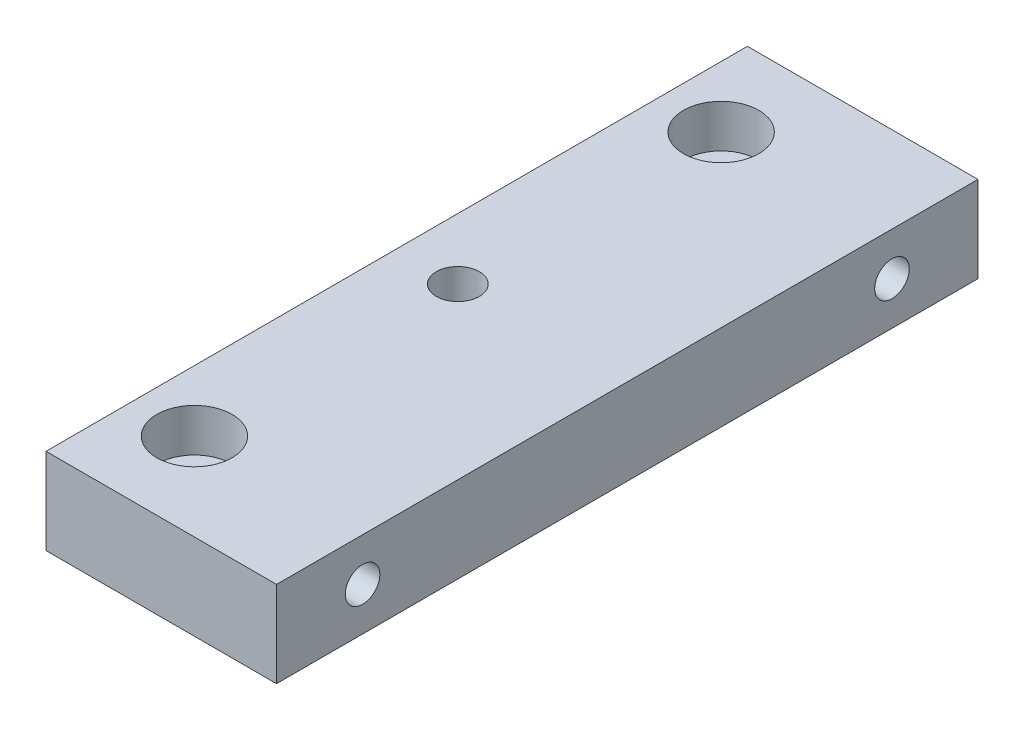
from build123d import *

# Parameters (mm, degrees)
SKETCH1_W                                        = 34.04235
SKETCH1_H                                        = 103.5812
BOSS_EXTRUDE1_DEPTH                              = 6.35
CBORE_FOR_1_4_SOCKET_HEAD_CAP_SCREW1_D           = 6.7564
CBORE_FOR_1_4_SOCKET_HEAD_CAP_SCREW1_CBORE_D     = 11.1125
CBORE_FOR_1_4_SOCKET_HEAD_CAP_SCREW1_CBORE_DEPTH = 6.35
F_1_4_0_2500_DOWEL_HOLE1_D                       = 6.35
F_1_4_20_TAPPED_HOLE1_D                          = 5.1054
F_1_4_20_TAPPED_HOLE1_DEPTH                      = 16.51
F_1_4_20_TAPPED_HOLE1_TIP                        = 1.533816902


with BuildPart() as part:
    # Sketch1 → Boss-Extrude1 (new, symmetric)
    with BuildSketch(Plane(origin=(0, 0, 0), x_dir=(1, 0, 0), z_dir=(0, 1, 0))):
        Rectangle(SKETCH1_W, SKETCH1_H)
    extrude(amount=BOSS_EXTRUDE1_DEPTH, both=True)

    # CBORE for 1_4 Socket Head Cap Screw1 (through all)
    with Locations(Plane(origin=(0, 6.35, 0), x_dir=(1, 0, 0), z_dir=(0, 1, 0))):
        with Locations((-8.004175, -38.8874), (-8.004175, 38.8874)):
            CounterBoreHole(CBORE_FOR_1_4_SOCKET_HEAD_CAP_SCREW1_D / 2, CBORE_FOR_1_4_SOCKET_HEAD_CAP_SCREW1_CBORE_D / 2, CBORE_FOR_1_4_SOCKET_HEAD_CAP_SCREW1_CBORE_DEPTH)

    # 1_4 _0.2500_ Dowel Hole1 (through all)
    with Locations(Plane(origin=(0, -6.35, 0), x_dir=(-1, 0, 0), z_dir=(0, -1, 0))):
        with Locations((8.004175, 0)):
            Hole(F_1_4_0_2500_DOWEL_HOLE1_D / 2)

    # 1_4-20 Tapped Hole1
    with Locations(Plane(origin=(17.021175, 0, 0), x_dir=(0, 0, -1), z_dir=(1, 0, 0))):
        with Locations((39.0906, 0), (-39.0906, 0)):
            Hole(F_1_4_20_TAPPED_HOLE1_D / 2, depth=F_1_4_20_TAPPED_HOLE1_DEPTH)
            with Locations((0, 0, -(F_1_4_20_TAPPED_HOLE1_DEPTH + F_1_4_20_TAPPED_HOLE1_TIP / 2))):  # 118° drill point
                Cone(0, F_1_4_20_TAPPED_HOLE1_D / 2, F_1_4_20_TAPPED_HOLE1_TIP, mode=Mode.SUBTRACT)


solid = part.part
